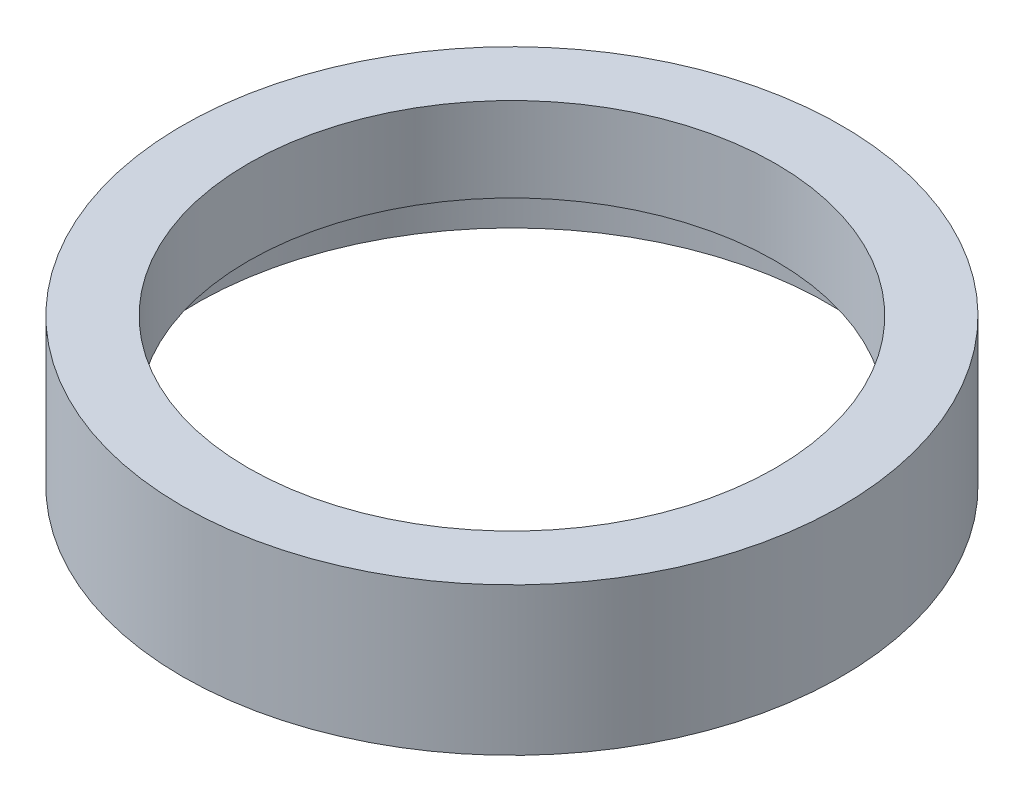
from build123d import *
from build123d.topology import SkipClean

# Parameters (mm, degrees)
SKETCH1_R           = 62.5
SKETCH1_R_2         = 60
BOSS_EXTRUDE1_DEPTH = 18
SKETCH2_R           = 62.5
SKETCH2_R_2         = 50
BOSS_EXTRUDE2_DEPTH = 10
BOSS_EXTRUDE3_START = 6
SKETCH3_R           = 54
SKETCH3_R_2         = 50
BOSS_EXTRUDE3_DEPTH = 6


with BuildPart() as part:
    # Sketch1 → Boss-Extrude1 (new body)
    with BuildSketch(Plane(origin=(0, 0, 0), x_dir=(1, 0, 0), z_dir=(0, 1, 0))):
        with Locations(Location((0, 0, 0), (0, 0, 270))):
            Circle(SKETCH1_R)
        with Locations(Location((0, 0, 0), (0, 0, 270))):
            Circle(SKETCH1_R_2, mode=Mode.SUBTRACT)
    extrude(amount=BOSS_EXTRUDE1_DEPTH)

    # Sketch2 → Boss-Extrude2 (add)
    with BuildSketch(Plane(origin=(0, 18, 0), x_dir=(1, 0, 0), z_dir=(0, 1, 0))):
        with Locations(Location((0, 0, 0), (0, 0, 270))):
            Circle(SKETCH2_R)
        with Locations(Location((0, 0, 0), (0, 0, 270))):
            Circle(SKETCH2_R_2, mode=Mode.SUBTRACT)
    extrude(amount=BOSS_EXTRUDE2_DEPTH)

    # Sketch3 → Boss-Extrude3 (add)
    with SkipClean():  # the faces are left unmerged after this step: merging them gives an invalid solid
        with BuildSketch(Plane.XZ.offset(-18).offset(BOSS_EXTRUDE3_START)):
            with Locations(Location((0, 0, 0), (0, 0, 90))):
                Circle(SKETCH3_R)
            with Locations(Location((0, 0, 0), (0, 0, 270))):
                Circle(SKETCH3_R_2, mode=Mode.SUBTRACT)
        extrude(amount=-BOSS_EXTRUDE3_DEPTH)


solid = part.part
